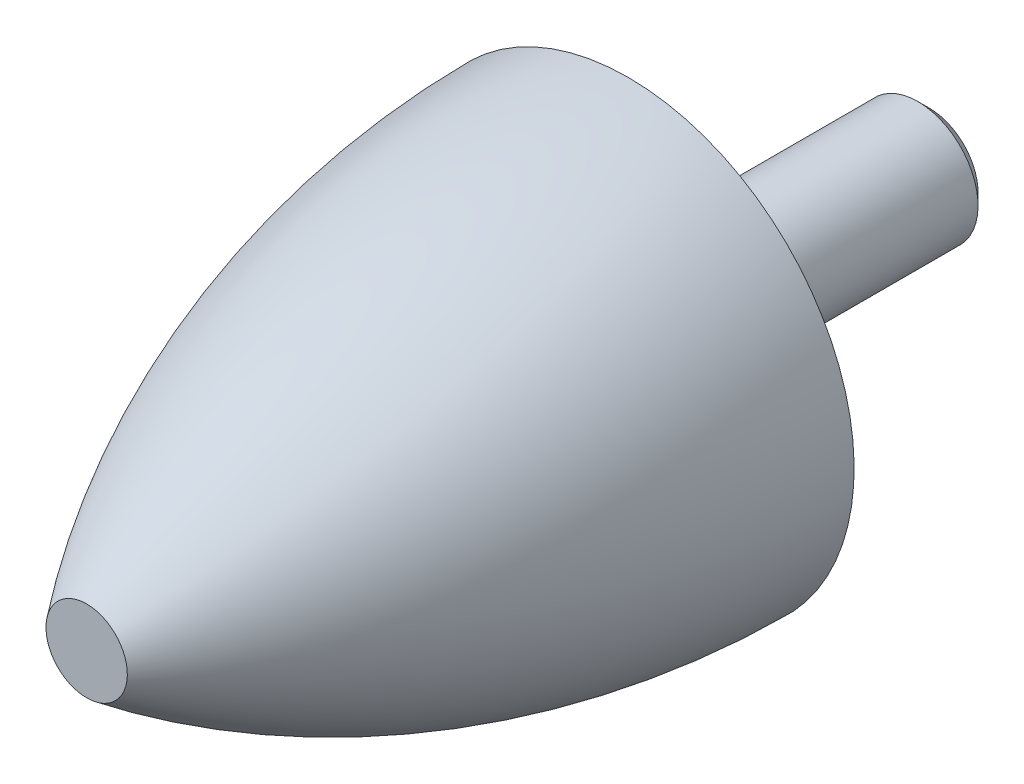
ISO-10303-21;
HEADER;
FILE_DESCRIPTION(('STEP AP214'),'2;1');
FILE_NAME('part.step','',(''),(''),'','','');
FILE_SCHEMA(('AUTOMOTIVE_DESIGN { 1 0 10303 214 1 1 1 1 }'));
ENDSEC;
DATA;
#1=APPLICATION_CONTEXT('core data for automotive mechanical design processes');
#2=APPLICATION_PROTOCOL_DEFINITION('international standard','automotive_design',2000,#1);
#3=PRODUCT_CONTEXT('',#1,'mechanical');
#4=PRODUCT('Part','Part','',(#3));
#5=PRODUCT_RELATED_PRODUCT_CATEGORY('part','',(#4));
#6=PRODUCT_DEFINITION_FORMATION('','',#4);
#7=PRODUCT_DEFINITION_CONTEXT('part definition',#1,'design');
#8=PRODUCT_DEFINITION('design','',#6,#7);
#9=PRODUCT_DEFINITION_SHAPE('','',#8);
#10=(LENGTH_UNIT() NAMED_UNIT(*) SI_UNIT(.MILLI.,.METRE.));
#11=(NAMED_UNIT(*) PLANE_ANGLE_UNIT() SI_UNIT($,.RADIAN.));
#12=(NAMED_UNIT(*) SI_UNIT($,.STERADIAN.) SOLID_ANGLE_UNIT());
#13=UNCERTAINTY_MEASURE_WITH_UNIT(LENGTH_MEASURE(1.E-05),#10,'distance_accuracy_value','');
#14=(GEOMETRIC_REPRESENTATION_CONTEXT(3) GLOBAL_UNCERTAINTY_ASSIGNED_CONTEXT((#13)) GLOBAL_UNIT_ASSIGNED_CONTEXT((#10,
#11,#12)) REPRESENTATION_CONTEXT('',''));
#15=CARTESIAN_POINT('',(0.,0.,0.));
#16=DIRECTION('',(0.,0.,1.));
#17=DIRECTION('',(1.,0.,0.));
#18=AXIS2_PLACEMENT_3D('',#15,#16,#17);
#19=CARTESIAN_POINT('',(15.,0.,-2.83898338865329E-13));
#20=DIRECTION('',(0.,0.,1.));
#21=DIRECTION('',(0.,-1.,0.));
#22=AXIS2_PLACEMENT_3D('',#19,#20,#21);
#23=PLANE('',#22);
#24=CARTESIAN_POINT('',(0.,0.,0.));
#25=DIRECTION('',(0.,0.,-1.));
#26=DIRECTION('',(0.,1.,0.));
#27=AXIS2_PLACEMENT_3D('',#24,#25,#26);
#28=CIRCLE('',#27,4.);
#29=CARTESIAN_POINT('',(0.,4.,0.));
#30=VERTEX_POINT('',#29);
#31=EDGE_CURVE('E23',#30,#30,#28,.T.);
#32=ORIENTED_EDGE('',*,*,#31,.F.);
#33=EDGE_LOOP('',(#32));
#34=FACE_BOUND('',#33,.T.);
#35=CARTESIAN_POINT('',(0.,0.,-5.67796677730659E-13));
#36=DIRECTION('',(0.,0.,-1.));
#37=DIRECTION('',(0.,1.,0.));
#38=AXIS2_PLACEMENT_3D('',#35,#36,#37);
#39=CIRCLE('',#38,15.);
#40=CARTESIAN_POINT('',(0.,15.,-5.67796677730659E-13));
#41=VERTEX_POINT('',#40);
#42=EDGE_CURVE('E19',#41,#41,#39,.T.);
#43=ORIENTED_EDGE('',*,*,#42,.T.);
#44=EDGE_LOOP('',(#43));
#45=FACE_BOUND('',#44,.T.);
#46=ADVANCED_FACE('F12',(#34,#45),#23,.F.);
#47=CARTESIAN_POINT('',(0.,0.,36.));
#48=DIRECTION('',(0.,0.,-1.));
#49=DIRECTION('',(0.,1.,0.));
#50=AXIS2_PLACEMENT_3D('',#47,#48,#49);
#51=PLANE('',#50);
#52=CARTESIAN_POINT('',(0.,0.,36.));
#53=DIRECTION('',(0.,0.,-1.));
#54=DIRECTION('',(0.,1.,0.));
#55=AXIS2_PLACEMENT_3D('',#52,#53,#54);
#56=CIRCLE('',#55,2.70270270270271);
#57=CARTESIAN_POINT('',(0.,2.70270270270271,36.));
#58=VERTEX_POINT('',#57);
#59=EDGE_CURVE('E8',#58,#58,#56,.T.);
#60=ORIENTED_EDGE('',*,*,#59,.F.);
#61=EDGE_LOOP('',(#60));
#62=FACE_BOUND('',#61,.T.);
#63=ADVANCED_FACE('F14',(#62),#51,.F.);
#64=CARTESIAN_POINT('',(0.,0.,-0.394725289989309));
#65=DIRECTION('',(0.,0.,-1.));
#66=DIRECTION('',(0.,1.,0.));
#67=AXIS2_PLACEMENT_3D('',#64,#65,#66);
#68=DEGENERATE_TOROIDAL_SURFACE('',#67,44.9987015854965,60.,.F.);
#69=ORIENTED_EDGE('',*,*,#59,.T.);
#70=EDGE_LOOP('',(#69));
#71=FACE_BOUND('',#70,.T.);
#72=ORIENTED_EDGE('',*,*,#42,.F.);
#73=EDGE_LOOP('',(#72));
#74=FACE_BOUND('',#73,.T.);
#75=ADVANCED_FACE('F47',(#71,#74),#68,.F.);
#76=CARTESIAN_POINT('',(0.,0.,-20.));
#77=DIRECTION('',(0.,0.,-1.));
#78=DIRECTION('',(0.,1.,0.));
#79=AXIS2_PLACEMENT_3D('',#76,#77,#78);
#80=CYLINDRICAL_SURFACE('',#79,4.);
#81=CARTESIAN_POINT('',(0.,0.,-19.233));
#82=DIRECTION('',(0.,0.,-1.));
#83=DIRECTION('',(0.,1.,0.));
#84=AXIS2_PLACEMENT_3D('',#81,#82,#83);
#85=CIRCLE('',#84,4.);
#86=CARTESIAN_POINT('',(0.,4.,-19.233));
#87=VERTEX_POINT('',#86);
#88=EDGE_CURVE('E27',#87,#87,#85,.T.);
#89=ORIENTED_EDGE('',*,*,#88,.F.);
#90=EDGE_LOOP('',(#89));
#91=FACE_BOUND('',#90,.T.);
#92=ORIENTED_EDGE('',*,*,#31,.T.);
#93=EDGE_LOOP('',(#92));
#94=FACE_BOUND('',#93,.T.);
#95=ADVANCED_FACE('F41',(#91,#94),#80,.T.);
#96=CARTESIAN_POINT('',(0.,0.,-19.233));
#97=DIRECTION('',(0.,0.,1.));
#98=DIRECTION('',(0.,-1.,0.));
#99=AXIS2_PLACEMENT_3D('',#96,#97,#98);
#100=CONICAL_SURFACE('',#99,4.,0.785398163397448);
#101=CARTESIAN_POINT('',(0.,0.,-20.));
#102=DIRECTION('',(0.,0.,-1.));
#103=DIRECTION('',(0.,1.,0.));
#104=AXIS2_PLACEMENT_3D('',#101,#102,#103);
#105=CIRCLE('',#104,3.233);
#106=CARTESIAN_POINT('',(0.,3.233,-20.));
#107=VERTEX_POINT('',#106);
#108=EDGE_CURVE('E32',#107,#107,#105,.T.);
#109=ORIENTED_EDGE('',*,*,#108,.F.);
#110=EDGE_LOOP('',(#109));
#111=FACE_BOUND('',#110,.T.);
#112=ORIENTED_EDGE('',*,*,#88,.T.);
#113=EDGE_LOOP('',(#112));
#114=FACE_BOUND('',#113,.T.);
#115=ADVANCED_FACE('F38',(#111,#114),#100,.T.);
#116=CARTESIAN_POINT('',(3.233,0.,-20.));
#117=DIRECTION('',(0.,0.,1.));
#118=DIRECTION('',(0.,-1.,0.));
#119=AXIS2_PLACEMENT_3D('',#116,#117,#118);
#120=PLANE('',#119);
#121=ORIENTED_EDGE('',*,*,#108,.T.);
#122=EDGE_LOOP('',(#121));
#123=FACE_BOUND('',#122,.T.);
#124=ADVANCED_FACE('F36',(#123),#120,.F.);
#125=CLOSED_SHELL('',(#46,#63,#75,#95,#115,#124));
#126=MANIFOLD_SOLID_BREP('B1',#125);
#127=ADVANCED_BREP_SHAPE_REPRESENTATION('',(#18,#126),#14);
#128=SHAPE_DEFINITION_REPRESENTATION(#9,#127);
ENDSEC;
END-ISO-10303-21;
